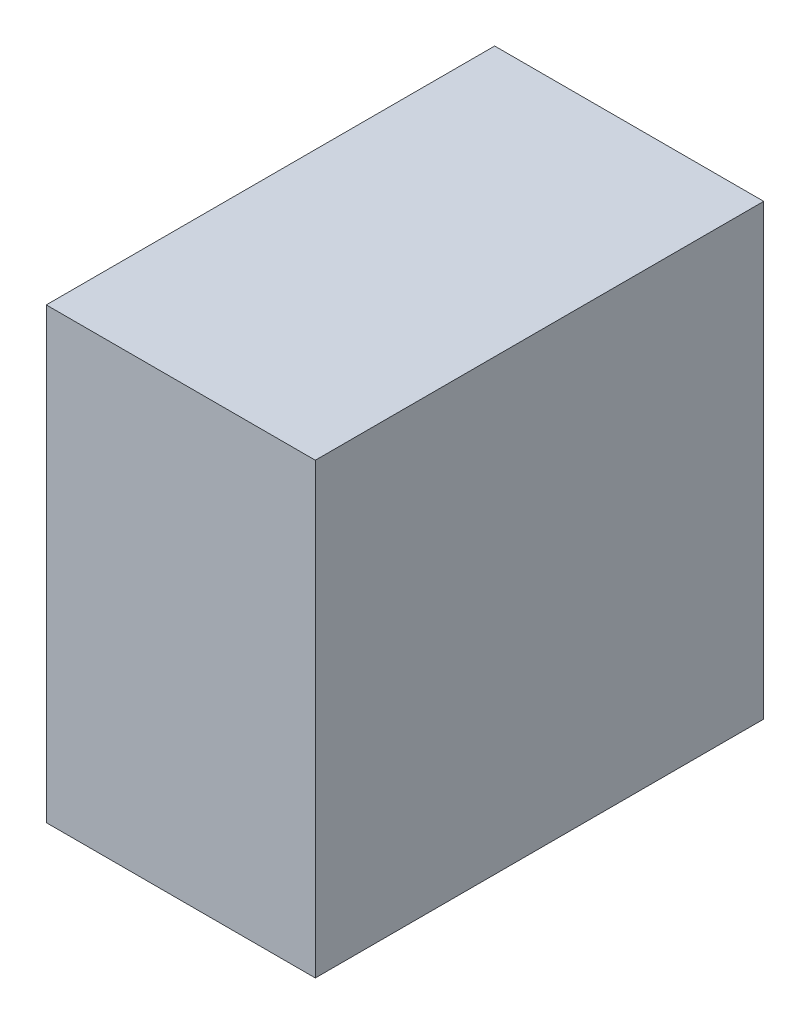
ISO-10303-21;
HEADER;
FILE_DESCRIPTION(('STEP AP214'),'2;1');
FILE_NAME('part.step','',(''),(''),'','','');
FILE_SCHEMA(('AUTOMOTIVE_DESIGN { 1 0 10303 214 1 1 1 1 }'));
ENDSEC;
DATA;
#1=APPLICATION_CONTEXT('core data for automotive mechanical design processes');
#2=APPLICATION_PROTOCOL_DEFINITION('international standard','automotive_design',2000,#1);
#3=PRODUCT_CONTEXT('',#1,'mechanical');
#4=PRODUCT('Part','Part','',(#3));
#5=PRODUCT_RELATED_PRODUCT_CATEGORY('part','',(#4));
#6=PRODUCT_DEFINITION_FORMATION('','',#4);
#7=PRODUCT_DEFINITION_CONTEXT('part definition',#1,'design');
#8=PRODUCT_DEFINITION('design','',#6,#7);
#9=PRODUCT_DEFINITION_SHAPE('','',#8);
#10=(LENGTH_UNIT() NAMED_UNIT(*) SI_UNIT(.MILLI.,.METRE.));
#11=(NAMED_UNIT(*) PLANE_ANGLE_UNIT() SI_UNIT($,.RADIAN.));
#12=(NAMED_UNIT(*) SI_UNIT($,.STERADIAN.) SOLID_ANGLE_UNIT());
#13=UNCERTAINTY_MEASURE_WITH_UNIT(LENGTH_MEASURE(1.E-05),#10,'distance_accuracy_value','');
#14=(GEOMETRIC_REPRESENTATION_CONTEXT(3) GLOBAL_UNCERTAINTY_ASSIGNED_CONTEXT((#13)) GLOBAL_UNIT_ASSIGNED_CONTEXT((#10,
#11,#12)) REPRESENTATION_CONTEXT('',''));
#15=CARTESIAN_POINT('',(0.,0.,0.));
#16=DIRECTION('',(0.,0.,1.));
#17=DIRECTION('',(1.,0.,0.));
#18=AXIS2_PLACEMENT_3D('',#15,#16,#17);
#19=CARTESIAN_POINT('',(0.,0.,30.));
#20=DIRECTION('',(1.,0.,0.));
#21=DIRECTION('',(0.,0.,-1.));
#22=AXIS2_PLACEMENT_3D('',#19,#20,#21);
#23=PLANE('',#22);
#24=DIRECTION('',(0.,-1.,0.));
#25=VECTOR('',#24,1.);
#26=CARTESIAN_POINT('',(0.,0.,0.));
#27=LINE('',#26,#25);
#28=CARTESIAN_POINT('',(0.,30.,0.));
#29=VERTEX_POINT('',#28);
#30=CARTESIAN_POINT('',(0.,0.,0.));
#31=VERTEX_POINT('',#30);
#32=EDGE_CURVE('E70',#29,#31,#27,.T.);
#33=ORIENTED_EDGE('',*,*,#32,.T.);
#34=DIRECTION('',(0.,0.,-1.));
#35=VECTOR('',#34,1.);
#36=CARTESIAN_POINT('',(0.,0.,30.));
#37=LINE('',#36,#35);
#38=CARTESIAN_POINT('',(0.,0.,30.));
#39=VERTEX_POINT('',#38);
#40=EDGE_CURVE('E11',#39,#31,#37,.T.);
#41=ORIENTED_EDGE('',*,*,#40,.F.);
#42=DIRECTION('',(0.,-1.,0.));
#43=VECTOR('',#42,1.);
#44=CARTESIAN_POINT('',(0.,0.,30.));
#45=LINE('',#44,#43);
#46=CARTESIAN_POINT('',(0.,30.,30.));
#47=VERTEX_POINT('',#46);
#48=EDGE_CURVE('E88',#47,#39,#45,.T.);
#49=ORIENTED_EDGE('',*,*,#48,.F.);
#50=DIRECTION('',(0.,0.,-1.));
#51=VECTOR('',#50,1.);
#52=CARTESIAN_POINT('',(0.,30.,30.));
#53=LINE('',#52,#51);
#54=EDGE_CURVE('E82',#47,#29,#53,.T.);
#55=ORIENTED_EDGE('',*,*,#54,.T.);
#56=EDGE_LOOP('',(#33,#41,#49,#55));
#57=FACE_BOUND('',#56,.T.);
#58=ADVANCED_FACE('F26',(#57),#23,.F.);
#59=CARTESIAN_POINT('',(0.,0.,30.));
#60=DIRECTION('',(0.,1.,0.));
#61=DIRECTION('',(0.,0.,1.));
#62=AXIS2_PLACEMENT_3D('',#59,#60,#61);
#63=PLANE('',#62);
#64=DIRECTION('',(1.,0.,0.));
#65=VECTOR('',#64,1.);
#66=CARTESIAN_POINT('',(0.,0.,0.));
#67=LINE('',#66,#65);
#68=CARTESIAN_POINT('',(18.,0.,0.));
#69=VERTEX_POINT('',#68);
#70=EDGE_CURVE('E66',#31,#69,#67,.T.);
#71=ORIENTED_EDGE('',*,*,#70,.T.);
#72=DIRECTION('',(0.,0.,-1.));
#73=VECTOR('',#72,1.);
#74=CARTESIAN_POINT('',(18.,0.,30.));
#75=LINE('',#74,#73);
#76=CARTESIAN_POINT('',(18.,0.,30.));
#77=VERTEX_POINT('',#76);
#78=EDGE_CURVE('E33',#77,#69,#75,.T.);
#79=ORIENTED_EDGE('',*,*,#78,.F.);
#80=DIRECTION('',(1.,0.,0.));
#81=VECTOR('',#80,1.);
#82=CARTESIAN_POINT('',(0.,0.,30.));
#83=LINE('',#82,#81);
#84=EDGE_CURVE('E78',#39,#77,#83,.T.);
#85=ORIENTED_EDGE('',*,*,#84,.F.);
#86=ORIENTED_EDGE('',*,*,#40,.T.);
#87=EDGE_LOOP('',(#71,#79,#85,#86));
#88=FACE_BOUND('',#87,.T.);
#89=ADVANCED_FACE('F77',(#88),#63,.F.);
#90=CARTESIAN_POINT('',(18.,0.,30.));
#91=DIRECTION('',(-1.,0.,0.));
#92=DIRECTION('',(0.,0.,1.));
#93=AXIS2_PLACEMENT_3D('',#90,#91,#92);
#94=PLANE('',#93);
#95=DIRECTION('',(0.,1.,0.));
#96=VECTOR('',#95,1.);
#97=CARTESIAN_POINT('',(18.,0.,0.));
#98=LINE('',#97,#96);
#99=CARTESIAN_POINT('',(18.,30.,0.));
#100=VERTEX_POINT('',#99);
#101=EDGE_CURVE('E71',#69,#100,#98,.T.);
#102=ORIENTED_EDGE('',*,*,#101,.T.);
#103=DIRECTION('',(0.,0.,-1.));
#104=VECTOR('',#103,1.);
#105=CARTESIAN_POINT('',(18.,30.,30.));
#106=LINE('',#105,#104);
#107=CARTESIAN_POINT('',(18.,30.,30.));
#108=VERTEX_POINT('',#107);
#109=EDGE_CURVE('E94',#108,#100,#106,.T.);
#110=ORIENTED_EDGE('',*,*,#109,.F.);
#111=DIRECTION('',(0.,1.,0.));
#112=VECTOR('',#111,1.);
#113=CARTESIAN_POINT('',(18.,0.,30.));
#114=LINE('',#113,#112);
#115=EDGE_CURVE('E45',#77,#108,#114,.T.);
#116=ORIENTED_EDGE('',*,*,#115,.F.);
#117=ORIENTED_EDGE('',*,*,#78,.T.);
#118=EDGE_LOOP('',(#102,#110,#116,#117));
#119=FACE_BOUND('',#118,.T.);
#120=ADVANCED_FACE('F97',(#119),#94,.F.);
#121=CARTESIAN_POINT('',(0.,30.,30.));
#122=DIRECTION('',(0.,-1.,0.));
#123=DIRECTION('',(0.,0.,-1.));
#124=AXIS2_PLACEMENT_3D('',#121,#122,#123);
#125=PLANE('',#124);
#126=DIRECTION('',(-1.,0.,0.));
#127=VECTOR('',#126,1.);
#128=CARTESIAN_POINT('',(0.,30.,0.));
#129=LINE('',#128,#127);
#130=EDGE_CURVE('E86',#100,#29,#129,.T.);
#131=ORIENTED_EDGE('',*,*,#130,.T.);
#132=ORIENTED_EDGE('',*,*,#54,.F.);
#133=DIRECTION('',(-1.,0.,0.));
#134=VECTOR('',#133,1.);
#135=CARTESIAN_POINT('',(0.,30.,30.));
#136=LINE('',#135,#134);
#137=EDGE_CURVE('E40',#108,#47,#136,.T.);
#138=ORIENTED_EDGE('',*,*,#137,.F.);
#139=ORIENTED_EDGE('',*,*,#109,.T.);
#140=EDGE_LOOP('',(#131,#132,#138,#139));
#141=FACE_BOUND('',#140,.T.);
#142=ADVANCED_FACE('F99',(#141),#125,.F.);
#143=CARTESIAN_POINT('',(0.,30.,30.));
#144=DIRECTION('',(0.,0.,-1.));
#145=DIRECTION('',(-1.,0.,0.));
#146=AXIS2_PLACEMENT_3D('',#143,#144,#145);
#147=PLANE('',#146);
#148=ORIENTED_EDGE('',*,*,#48,.T.);
#149=ORIENTED_EDGE('',*,*,#84,.T.);
#150=ORIENTED_EDGE('',*,*,#115,.T.);
#151=ORIENTED_EDGE('',*,*,#137,.T.);
#152=EDGE_LOOP('',(#148,#149,#150,#151));
#153=FACE_BOUND('',#152,.T.);
#154=ADVANCED_FACE('F100',(#153),#147,.F.);
#155=CARTESIAN_POINT('',(0.,30.,0.));
#156=DIRECTION('',(0.,0.,-1.));
#157=DIRECTION('',(-1.,0.,0.));
#158=AXIS2_PLACEMENT_3D('',#155,#156,#157);
#159=PLANE('',#158);
#160=ORIENTED_EDGE('',*,*,#32,.F.);
#161=ORIENTED_EDGE('',*,*,#130,.F.);
#162=ORIENTED_EDGE('',*,*,#101,.F.);
#163=ORIENTED_EDGE('',*,*,#70,.F.);
#164=EDGE_LOOP('',(#160,#161,#162,#163));
#165=FACE_BOUND('',#164,.T.);
#166=ADVANCED_FACE('F67',(#165),#159,.T.);
#167=CLOSED_SHELL('',(#58,#89,#120,#142,#154,#166));
#168=MANIFOLD_SOLID_BREP('B2',#167);
#169=ADVANCED_BREP_SHAPE_REPRESENTATION('',(#18,#168),#14);
#170=SHAPE_DEFINITION_REPRESENTATION(#9,#169);
ENDSEC;
END-ISO-10303-21;
